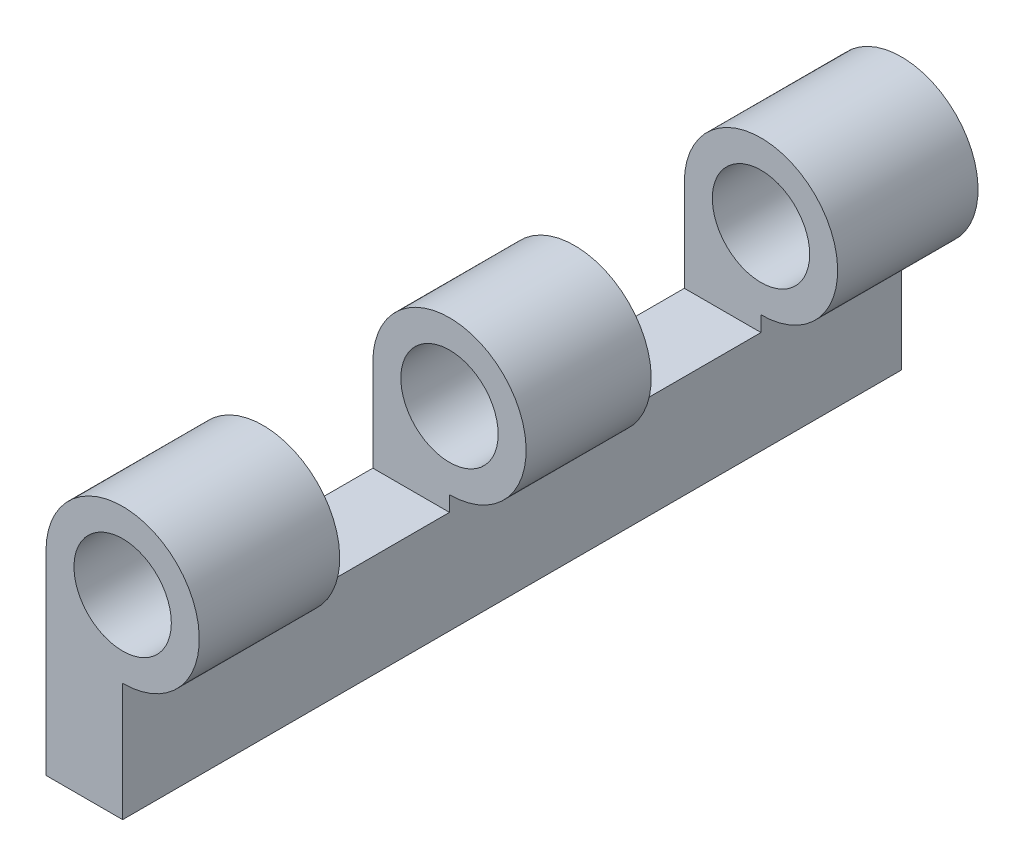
from build123d import *

# Parameters (mm, degrees)
SKETCH1_W           = 5
SKETCH1_H           = 12.7
EXTRUDE_THIN1_DEPTH = 25.4
SKETCH2_R           = 5
SKETCH3_R           = 3.175
CUT_EXTRUDE1_DEPTH  = 55.716816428
F_2CUTS_DEPTH       = 32.360006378
F_2CUTS_DEPTH_BACK  = 32.360006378
SKETCH10_W          = 12.16
SKETCH10_H          = 11


with BuildPart() as part:
    # Sketch1 → Extrude-Thin1 (new, symmetric)
    with BuildSketch(Plane.XY):
        with Locations((2.5, 6.35)):
            Rectangle(SKETCH1_W, SKETCH1_H)
    extrude(amount=EXTRUDE_THIN1_DEPTH, both=True)

    # Sweep1: sweep along a curve in space
    with BuildLine() as sweep1_path:
        Line((0, 12.7, 25.4), (0, 12.7, -25.4))
    # Sketch2 → Sweep1 (sweep)
    with BuildSketch(Plane.XY.offset(25.4)):
        with Locations((5, 12.7)):
            Circle(SKETCH2_R)
    sweep(path=sweep1_path.line)

    # Sketch3 → Cut-Extrude1 (cut, through all)
    with BuildSketch(Plane.XY.offset(25.4)):
        with Locations((5, 12.7)):
            Circle(SKETCH3_R)
    extrude(amount=-CUT_EXTRUDE1_DEPTH, mode=Mode.SUBTRACT)

    # Sketch10 → 2Cuts (cut, two sides: drawn at the far end of the back side and taken through both)
    with BuildSketch(Plane(origin=(5, 0, 0), x_dir=(0, 0, -1), z_dir=(1, 0, 0)).offset(-F_2CUTS_DEPTH_BACK)):
        with Locations((-10.16, 12.2)):
            Rectangle(SKETCH10_W, SKETCH10_H)
        with Locations((10.16, 12.2)):
            Rectangle(SKETCH10_W, SKETCH10_H)
    extrude(amount=F_2CUTS_DEPTH + F_2CUTS_DEPTH_BACK, mode=Mode.SUBTRACT)


solid = part.part
